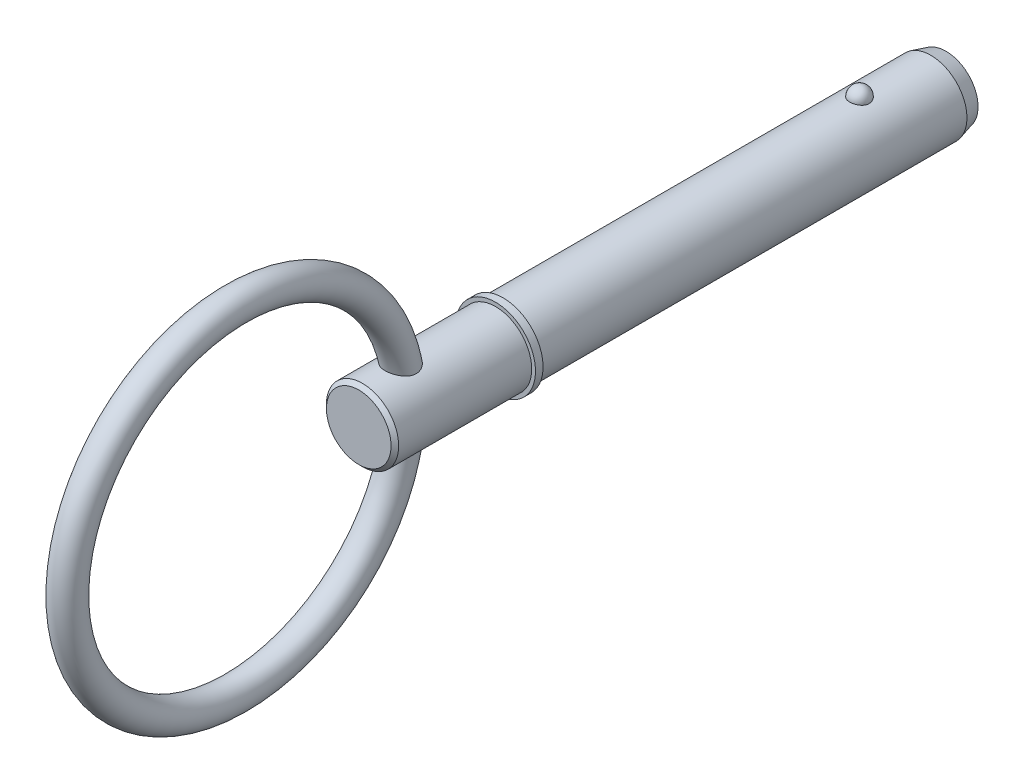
ISO-10303-21;
HEADER;
FILE_DESCRIPTION(('STEP AP214'),'2;1');
FILE_NAME('part.step','',(''),(''),'','','');
FILE_SCHEMA(('AUTOMOTIVE_DESIGN { 1 0 10303 214 1 1 1 1 }'));
ENDSEC;
DATA;
#1=APPLICATION_CONTEXT('core data for automotive mechanical design processes');
#2=APPLICATION_PROTOCOL_DEFINITION('international standard','automotive_design',2000,#1);
#3=PRODUCT_CONTEXT('',#1,'mechanical');
#4=PRODUCT('Part','Part','',(#3));
#5=PRODUCT_RELATED_PRODUCT_CATEGORY('part','',(#4));
#6=PRODUCT_DEFINITION_FORMATION('','',#4);
#7=PRODUCT_DEFINITION_CONTEXT('part definition',#1,'design');
#8=PRODUCT_DEFINITION('design','',#6,#7);
#9=PRODUCT_DEFINITION_SHAPE('','',#8);
#10=(LENGTH_UNIT() NAMED_UNIT(*) SI_UNIT(.MILLI.,.METRE.));
#11=(NAMED_UNIT(*) PLANE_ANGLE_UNIT() SI_UNIT($,.RADIAN.));
#12=(NAMED_UNIT(*) SI_UNIT($,.STERADIAN.) SOLID_ANGLE_UNIT());
#13=UNCERTAINTY_MEASURE_WITH_UNIT(LENGTH_MEASURE(1.E-05),#10,'distance_accuracy_value','');
#14=(GEOMETRIC_REPRESENTATION_CONTEXT(3) GLOBAL_UNCERTAINTY_ASSIGNED_CONTEXT((#13)) GLOBAL_UNIT_ASSIGNED_CONTEXT((#10,
#11,#12)) REPRESENTATION_CONTEXT('',''));
#15=CARTESIAN_POINT('',(0.,0.,0.));
#16=DIRECTION('',(0.,0.,1.));
#17=DIRECTION('',(1.,0.,0.));
#18=AXIS2_PLACEMENT_3D('',#15,#16,#17);
#19=CARTESIAN_POINT('',(0.,0.,45.72));
#20=DIRECTION('',(0.,0.,-1.));
#21=DIRECTION('',(-1.,0.,0.));
#22=AXIS2_PLACEMENT_3D('',#19,#20,#21);
#23=CYLINDRICAL_SURFACE('',#22,4.765);
#24=CARTESIAN_POINT('',(1.27812710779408,4.59038300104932,-1.29));
#25=CARTESIAN_POINT('',(1.27812572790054,4.59038414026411,-1.2178688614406));
#26=CARTESIAN_POINT('',(1.27223018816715,4.59203736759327,-1.14572000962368));
#27=CARTESIAN_POINT('',(1.24878929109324,4.59846646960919,-1.00346315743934));
#28=CARTESIAN_POINT('',(1.23123896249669,4.60324367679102,-0.933356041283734));
#29=CARTESIAN_POINT('',(1.18493861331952,4.61537801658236,-0.797215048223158));
#30=CARTESIAN_POINT('',(1.15619354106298,4.62273400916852,-0.731179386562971));
#31=CARTESIAN_POINT('',(1.08822596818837,4.6392032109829,-0.604986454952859));
#32=CARTESIAN_POINT('',(1.04900384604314,4.64831635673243,-0.544828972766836));
#33=CARTESIAN_POINT('',(0.960865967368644,4.66733302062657,-0.431775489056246));
#34=CARTESIAN_POINT('',(0.911906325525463,4.67723999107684,-0.37891426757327));
#35=CARTESIAN_POINT('',(0.805678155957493,4.69670280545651,-0.282245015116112));
#36=CARTESIAN_POINT('',(0.748409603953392,4.70625864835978,-0.238437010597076));
#37=CARTESIAN_POINT('',(0.627266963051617,4.72392767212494,-0.161207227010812));
#38=CARTESIAN_POINT('',(0.563411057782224,4.73204466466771,-0.127757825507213));
#39=CARTESIAN_POINT('',(0.430755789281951,4.74595788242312,-0.0720471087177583));
#40=CARTESIAN_POINT('',(0.361956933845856,4.75175434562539,-0.0497846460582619));
#41=CARTESIAN_POINT('',(0.222605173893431,4.76030056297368,-0.0173750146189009));
#42=CARTESIAN_POINT('',(0.152101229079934,4.76309991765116,-0.00703038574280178));
#43=CARTESIAN_POINT('',(0.0103009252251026,4.76551622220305,0.00191361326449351));
#44=CARTESIAN_POINT('',(-0.0609953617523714,4.76513345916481,0.000514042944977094));
#45=CARTESIAN_POINT('',(-0.201348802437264,4.76125496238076,-0.0138891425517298));
#46=CARTESIAN_POINT('',(-0.270423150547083,4.75780093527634,-0.0267372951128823));
#47=CARTESIAN_POINT('',(-0.405377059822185,4.74820737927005,-0.0634598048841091));
#48=CARTESIAN_POINT('',(-0.471256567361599,4.74206780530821,-0.0873343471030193));
#49=CARTESIAN_POINT('',(-0.598375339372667,4.72771507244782,-0.14561183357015));
#50=CARTESIAN_POINT('',(-0.659587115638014,4.71949070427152,-0.180071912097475));
#51=CARTESIAN_POINT('',(-0.775356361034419,4.70185936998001,-0.258542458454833));
#52=CARTESIAN_POINT('',(-0.8299131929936,4.69245229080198,-0.302553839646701));
#53=CARTESIAN_POINT('',(-0.931895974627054,4.67327936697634,-0.39982907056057));
#54=CARTESIAN_POINT('',(-0.979176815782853,4.66351011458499,-0.453244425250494));
#55=CARTESIAN_POINT('',(-1.06421220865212,4.64484426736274,-0.567321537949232));
#56=CARTESIAN_POINT('',(-1.10196613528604,4.63594772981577,-0.6279837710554));
#57=CARTESIAN_POINT('',(-1.16735225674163,4.61992036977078,-0.75558557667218));
#58=CARTESIAN_POINT('',(-1.19487251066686,4.61280933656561,-0.822585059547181));
#59=CARTESIAN_POINT('',(-1.23851975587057,4.60128324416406,-0.96041771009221));
#60=CARTESIAN_POINT('',(-1.25464705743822,4.59686811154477,-1.03125077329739));
#61=CARTESIAN_POINT('',(-1.27505790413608,4.59124882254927,-1.17443804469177));
#62=CARTESIAN_POINT('',(-1.27938868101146,4.59003186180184,-1.24678501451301));
#63=CARTESIAN_POINT('',(-1.27623192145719,4.5909105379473,-1.3911989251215));
#64=CARTESIAN_POINT('',(-1.26874468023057,4.59300609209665,-1.46326587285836));
#65=CARTESIAN_POINT('',(-1.24220427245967,4.60025423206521,-1.60473192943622));
#66=CARTESIAN_POINT('',(-1.2232043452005,4.60539274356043,-1.67414176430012));
#67=CARTESIAN_POINT('',(-1.17415910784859,4.61813957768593,-1.80870154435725));
#68=CARTESIAN_POINT('',(-1.1441133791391,4.62574799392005,-1.87385132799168));
#69=CARTESIAN_POINT('',(-1.07354327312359,4.64263368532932,-1.99841604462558));
#70=CARTESIAN_POINT('',(-1.03296580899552,4.65191934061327,-2.05779976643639));
#71=CARTESIAN_POINT('',(-0.942433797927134,4.67110036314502,-2.16881966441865));
#72=CARTESIAN_POINT('',(-0.892478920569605,4.68099575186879,-2.22045556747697));
#73=CARTESIAN_POINT('',(-0.784302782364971,4.70033161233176,-2.31471696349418));
#74=CARTESIAN_POINT('',(-0.726054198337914,4.70977043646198,-2.35731146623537));
#75=CARTESIAN_POINT('',(-0.602997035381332,4.72709995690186,-2.43206620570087));
#76=CARTESIAN_POINT('',(-0.538188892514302,4.73499075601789,-2.46422713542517));
#77=CARTESIAN_POINT('',(-0.404639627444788,4.7482563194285,-2.51687454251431));
#78=CARTESIAN_POINT('',(-0.335953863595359,4.7536596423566,-2.53749415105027));
#79=CARTESIAN_POINT('',(-0.195948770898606,4.76148510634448,-2.56703727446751));
#80=CARTESIAN_POINT('',(-0.124629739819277,4.76390758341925,-2.57596210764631));
#81=CARTESIAN_POINT('',(0.0172696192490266,4.76548774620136,-2.58180339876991));
#82=CARTESIAN_POINT('',(0.0878407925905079,4.76470225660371,-2.57892886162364));
#83=CARTESIAN_POINT('',(0.227467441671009,4.76008019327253,-2.56172603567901));
#84=CARTESIAN_POINT('',(0.296522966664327,4.75624371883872,-2.54739811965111));
#85=CARTESIAN_POINT('',(0.430942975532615,4.74595041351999,-2.50776251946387));
#86=CARTESIAN_POINT('',(0.496319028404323,4.7395023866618,-2.4824917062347));
#87=CARTESIAN_POINT('',(0.621860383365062,4.72467083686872,-2.4216730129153));
#88=CARTESIAN_POINT('',(0.682025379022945,4.71628720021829,-2.38612452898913));
#89=CARTESIAN_POINT('',(0.796409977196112,4.69833598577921,-2.30511163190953));
#90=CARTESIAN_POINT('',(0.850529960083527,4.68875291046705,-2.25951003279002));
#91=CARTESIAN_POINT('',(0.950412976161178,4.66953243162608,-2.15992428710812));
#92=CARTESIAN_POINT('',(0.996174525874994,4.65989501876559,-2.10593865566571));
#93=CARTESIAN_POINT('',(1.07885962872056,4.64145616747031,-1.99009376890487));
#94=CARTESIAN_POINT('',(1.11562789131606,4.63267081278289,-1.92812106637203));
#95=CARTESIAN_POINT('',(1.17840570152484,4.61710269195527,-1.79873681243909));
#96=CARTESIAN_POINT('',(1.20441973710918,4.61031909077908,-1.73132754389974));
#97=CARTESIAN_POINT('',(1.24242116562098,4.60021170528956,-1.60192906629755));
#98=CARTESIAN_POINT('',(1.25578772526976,4.59655387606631,-1.54036674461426));
#99=CARTESIAN_POINT('',(1.27364121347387,4.59163904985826,-1.41587409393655));
#100=CARTESIAN_POINT('',(1.2781283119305,4.59038200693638,-1.35294379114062));
#101=CARTESIAN_POINT('',(1.27812710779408,4.59038300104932,-1.29));
#102=B_SPLINE_CURVE_WITH_KNOTS('',3,(#24,#25,#26,#27,#28,#29,#30,#31,#32,#33,#34,#35,#36,#37,
#38,#39,#40,#41,#42,#43,#44,#45,#46,#47,#48,#49,#50,#51,#52,#53,#54,#55,#56,#57,#58,#59,#60,#61,
#62,#63,#64,#65,#66,#67,#68,#69,#70,#71,#72,#73,#74,#75,#76,#77,#78,#79,#80,#81,#82,#83,#84,#85,
#86,#87,#88,#89,#90,#91,#92,#93,#94,#95,#96,#97,#98,#99,#100,#101),.UNSPECIFIED.,.T.,.F.,(4,2,2,
2,2,2,2,2,2,2,2,2,2,2,2,2,2,2,2,2,2,2,2,2,2,2,2,2,2,2,2,2,2,2,2,2,2,2,4),(0.,0.216167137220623,
0.432426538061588,0.648590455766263,0.864746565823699,1.0818998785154,1.29905382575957,
1.51562361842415,1.73217119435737,1.94507683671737,2.15796327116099,2.36800220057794,
2.57804465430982,2.78924132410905,3.00045819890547,3.21545551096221,3.43046692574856,
3.64776550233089,3.8650581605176,4.08147951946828,4.29789547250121,4.51331818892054,
4.72874907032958,4.94528769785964,5.16183395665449,5.37911087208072,5.59637335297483,
5.8110751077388,6.02575265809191,6.23664413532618,6.44752874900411,6.65770827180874,
6.86790014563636,7.08116060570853,7.29445887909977,7.51121476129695,7.72788009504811,
7.91651762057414,8.10515153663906),.UNSPECIFIED.);
#103=CARTESIAN_POINT('',(1.27812710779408,4.59038300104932,-1.29));
#104=VERTEX_POINT('',#103);
#105=EDGE_CURVE('E103',#104,#104,#102,.T.);
#106=ORIENTED_EDGE('',*,*,#105,.T.);
#107=EDGE_LOOP('',(#106));
#108=FACE_BOUND('',#107,.T.);
#109=CARTESIAN_POINT('',(0.,0.,-10.7));
#110=DIRECTION('',(0.,0.,-1.));
#111=DIRECTION('',(-1.,0.,0.));
#112=AXIS2_PLACEMENT_3D('',#109,#110,#111);
#113=CIRCLE('',#112,4.765);
#114=CARTESIAN_POINT('',(-4.765,0.,-10.7));
#115=VERTEX_POINT('',#114);
#116=EDGE_CURVE('E110',#115,#115,#113,.F.);
#117=ORIENTED_EDGE('',*,*,#116,.T.);
#118=EDGE_LOOP('',(#117));
#119=FACE_BOUND('',#118,.T.);
#120=CARTESIAN_POINT('',(0.,0.,45.72));
#121=DIRECTION('',(0.,0.,1.));
#122=DIRECTION('',(1.,0.,0.));
#123=AXIS2_PLACEMENT_3D('',#120,#121,#122);
#124=CIRCLE('',#123,4.765);
#125=CARTESIAN_POINT('',(4.765,0.,45.72));
#126=VERTEX_POINT('',#125);
#127=EDGE_CURVE('E108',#126,#126,#124,.T.);
#128=ORIENTED_EDGE('',*,*,#127,.F.);
#129=EDGE_LOOP('',(#128));
#130=FACE_BOUND('',#129,.T.);
#131=ADVANCED_FACE('F39',(#108,#119,#130),#23,.T.);
#132=CARTESIAN_POINT('',(0.,0.,-12.7));
#133=DIRECTION('',(0.,0.,-1.));
#134=DIRECTION('',(-1.,0.,0.));
#135=AXIS2_PLACEMENT_3D('',#132,#133,#134);
#136=PLANE('',#135);
#137=CARTESIAN_POINT('',(0.,0.,-12.7));
#138=DIRECTION('',(0.,0.,-1.));
#139=DIRECTION('',(-1.,0.,0.));
#140=AXIS2_PLACEMENT_3D('',#137,#138,#139);
#141=CIRCLE('',#140,4.22910161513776);
#142=CARTESIAN_POINT('',(-4.22910161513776,0.,-12.7));
#143=VERTEX_POINT('',#142);
#144=EDGE_CURVE('E142',#143,#143,#141,.T.);
#145=ORIENTED_EDGE('',*,*,#144,.T.);
#146=EDGE_LOOP('',(#145));
#147=FACE_BOUND('',#146,.T.);
#148=ADVANCED_FACE('F89',(#147),#136,.T.);
#149=CARTESIAN_POINT('',(0.,0.,-12.7));
#150=DIRECTION('',(0.,0.,1.));
#151=DIRECTION('',(1.,0.,0.));
#152=AXIS2_PLACEMENT_3D('',#149,#150,#151);
#153=CONICAL_SURFACE('',#152,4.22910161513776,0.261799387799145);
#154=ORIENTED_EDGE('',*,*,#116,.F.);
#155=EDGE_LOOP('',(#154));
#156=FACE_BOUND('',#155,.T.);
#157=ORIENTED_EDGE('',*,*,#144,.F.);
#158=EDGE_LOOP('',(#157));
#159=FACE_BOUND('',#158,.T.);
#160=ADVANCED_FACE('F95',(#156,#159),#153,.T.);
#161=CARTESIAN_POINT('',(0.,4.765,-1.29));
#162=DIRECTION('',(0.,1.,0.));
#163=DIRECTION('',(0.,0.,-1.));
#164=AXIS2_PLACEMENT_3D('',#161,#162,#163);
#165=SPHERICAL_SURFACE('',#164,1.29);
#166=ORIENTED_EDGE('',*,*,#105,.F.);
#167=EDGE_LOOP('',(#166));
#168=FACE_BOUND('',#167,.T.);
#169=ADVANCED_FACE('F113',(#168),#165,.T.);
#170=CARTESIAN_POINT('',(0.,0.,45.72));
#171=DIRECTION('',(0.,0.,-1.));
#172=DIRECTION('',(-1.,0.,0.));
#173=AXIS2_PLACEMENT_3D('',#170,#171,#172);
#174=PLANE('',#173);
#175=ORIENTED_EDGE('',*,*,#127,.T.);
#176=EDGE_LOOP('',(#175));
#177=FACE_BOUND('',#176,.T.);
#178=CARTESIAN_POINT('',(0.,0.,45.72));
#179=DIRECTION('',(0.,0.,-1.));
#180=DIRECTION('',(-1.,0.,0.));
#181=AXIS2_PLACEMENT_3D('',#178,#179,#180);
#182=CIRCLE('',#181,5.265);
#183=CARTESIAN_POINT('',(-5.265,0.,45.72));
#184=VERTEX_POINT('',#183);
#185=EDGE_CURVE('E109',#184,#184,#182,.T.);
#186=ORIENTED_EDGE('',*,*,#185,.T.);
#187=EDGE_LOOP('',(#186));
#188=FACE_BOUND('',#187,.T.);
#189=ADVANCED_FACE('F117',(#177,#188),#174,.T.);
#190=CARTESIAN_POINT('',(0.,0.,33.7287874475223));
#191=DIRECTION('',(0.,0.,-1.));
#192=DIRECTION('',(-1.,0.,0.));
#193=AXIS2_PLACEMENT_3D('',#190,#191,#192);
#194=CYLINDRICAL_SURFACE('',#193,5.265);
#195=CARTESIAN_POINT('',(0.,0.,46.72));
#196=DIRECTION('',(0.,0.,-1.));
#197=DIRECTION('',(-1.,0.,0.));
#198=AXIS2_PLACEMENT_3D('',#195,#196,#197);
#199=CIRCLE('',#198,5.265);
#200=CARTESIAN_POINT('',(-5.265,0.,46.72));
#201=VERTEX_POINT('',#200);
#202=EDGE_CURVE('E134',#201,#201,#199,.T.);
#203=ORIENTED_EDGE('',*,*,#202,.T.);
#204=EDGE_LOOP('',(#203));
#205=FACE_BOUND('',#204,.T.);
#206=ORIENTED_EDGE('',*,*,#185,.F.);
#207=EDGE_LOOP('',(#206));
#208=FACE_BOUND('',#207,.T.);
#209=ADVANCED_FACE('F121',(#205,#208),#194,.T.);
#210=CARTESIAN_POINT('',(0.,5.265,46.72));
#211=DIRECTION('',(0.,0.,1.));
#212=DIRECTION('',(1.,0.,0.));
#213=AXIS2_PLACEMENT_3D('',#210,#211,#212);
#214=PLANE('',#213);
#215=CARTESIAN_POINT('',(0.,0.,46.72));
#216=DIRECTION('',(0.,0.,1.));
#217=DIRECTION('',(1.,0.,0.));
#218=AXIS2_PLACEMENT_3D('',#215,#216,#217);
#219=CIRCLE('',#218,4.765);
#220=CARTESIAN_POINT('',(4.765,0.,46.72));
#221=VERTEX_POINT('',#220);
#222=EDGE_CURVE('E112',#221,#221,#219,.T.);
#223=ORIENTED_EDGE('',*,*,#222,.F.);
#224=EDGE_LOOP('',(#223));
#225=FACE_BOUND('',#224,.T.);
#226=ORIENTED_EDGE('',*,*,#202,.F.);
#227=EDGE_LOOP('',(#226));
#228=FACE_BOUND('',#227,.T.);
#229=ADVANCED_FACE('F86',(#225,#228),#214,.T.);
#230=CARTESIAN_POINT('',(0.,0.,64.77));
#231=DIRECTION('',(0.,0.,-1.));
#232=DIRECTION('',(-1.,0.,0.));
#233=AXIS2_PLACEMENT_3D('',#230,#231,#232);
#234=CYLINDRICAL_SURFACE('',#233,4.765);
#235=CARTESIAN_POINT('',(-1.17603588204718,-4.61759294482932,57.6037200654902));
#236=CARTESIAN_POINT('',(-1.08605054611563,-4.6405075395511,57.5415688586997));
#237=CARTESIAN_POINT('',(-0.990486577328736,-4.66202408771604,57.4867393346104));
#238=CARTESIAN_POINT('',(-0.790762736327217,-4.70002969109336,57.3929957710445));
#239=CARTESIAN_POINT('',(-0.686587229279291,-4.7165093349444,57.3541114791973));
#240=CARTESIAN_POINT('',(-0.472539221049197,-4.7427361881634,57.293267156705));
#241=CARTESIAN_POINT('',(-0.362665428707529,-4.7524818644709,57.2713109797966));
#242=CARTESIAN_POINT('',(-0.140482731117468,-4.7642267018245,57.2449366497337));
#243=CARTESIAN_POINT('',(-0.0281752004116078,-4.7662301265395,57.2405088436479));
#244=CARTESIAN_POINT('',(0.193745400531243,-4.76233166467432,57.2492082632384));
#245=CARTESIAN_POINT('',(0.303372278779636,-4.75656024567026,57.2620457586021));
#246=CARTESIAN_POINT('',(0.518724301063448,-4.73791484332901,57.3044340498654));
#247=CARTESIAN_POINT('',(0.624448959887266,-4.72503997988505,57.3339869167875));
#248=CARTESIAN_POINT('',(0.829434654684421,-4.69340588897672,57.4092085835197));
#249=CARTESIAN_POINT('',(0.92867434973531,-4.6746283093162,57.4549277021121));
#250=CARTESIAN_POINT('',(1.11777413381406,-4.63305392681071,57.5614733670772));
#251=CARTESIAN_POINT('',(1.20763216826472,-4.61025624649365,57.6223032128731));
#252=CARTESIAN_POINT('',(1.37762760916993,-4.56238439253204,57.7594393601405));
#253=CARTESIAN_POINT('',(1.45749020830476,-4.53726959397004,57.8360728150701));
#254=CARTESIAN_POINT('',(1.60275140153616,-4.48801828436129,58.0022939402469));
#255=CARTESIAN_POINT('',(1.66815155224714,-4.46388166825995,58.091880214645));
#256=CARTESIAN_POINT('',(1.78162069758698,-4.41980966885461,58.2804689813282));
#257=CARTESIAN_POINT('',(1.82993675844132,-4.3998162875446,58.3793086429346));
#258=CARTESIAN_POINT('',(1.90902953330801,-4.36608532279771,58.5847395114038));
#259=CARTESIAN_POINT('',(1.93981696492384,-4.35234391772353,58.6913259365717));
#260=CARTESIAN_POINT('',(1.9818112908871,-4.33337618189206,58.9023805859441));
#261=CARTESIAN_POINT('',(1.99406945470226,-4.32769391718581,59.00660066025));
#262=CARTESIAN_POINT('',(2.0025484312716,-4.32377679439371,59.2158125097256));
#263=CARTESIAN_POINT('',(1.99876733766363,-4.32554282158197,59.3208043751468));
#264=CARTESIAN_POINT('',(1.97595504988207,-4.33600911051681,59.5291056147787));
#265=CARTESIAN_POINT('',(1.95686739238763,-4.3447350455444,59.6324073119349));
#266=CARTESIAN_POINT('',(1.90457346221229,-4.36790947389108,59.8346792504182));
#267=CARTESIAN_POINT('',(1.87136191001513,-4.38236010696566,59.9336478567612));
#268=CARTESIAN_POINT('',(1.78747856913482,-4.41728816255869,60.1364706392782));
#269=CARTESIAN_POINT('',(1.73524632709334,-4.43826528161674,60.2395927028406));
#270=CARTESIAN_POINT('',(1.61607256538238,-4.48303292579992,60.4363865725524));
#271=CARTESIAN_POINT('',(1.5491157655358,-4.50682636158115,60.5300484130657));
#272=CARTESIAN_POINT('',(1.39359064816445,-4.55746895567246,60.7153838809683));
#273=CARTESIAN_POINT('',(1.30346928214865,-4.58437060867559,60.8057503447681));
#274=CARTESIAN_POINT('',(1.10794390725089,-4.6354985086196,60.9690111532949));
#275=CARTESIAN_POINT('',(1.00255934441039,-4.65972809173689,61.0419274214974));
#276=CARTESIAN_POINT('',(0.803761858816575,-4.69755503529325,61.1524077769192));
#277=CARTESIAN_POINT('',(0.712935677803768,-4.71231838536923,61.1942306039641));
#278=CARTESIAN_POINT('',(0.525172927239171,-4.73691370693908,61.2629362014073));
#279=CARTESIAN_POINT('',(0.428242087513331,-4.7467502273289,61.2898327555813));
#280=CARTESIAN_POINT('',(0.230351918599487,-4.76046566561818,61.3271470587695));
#281=CARTESIAN_POINT('',(0.129376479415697,-4.76431768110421,61.3374904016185));
#282=CARTESIAN_POINT('',(-0.0728965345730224,-4.76551495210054,61.3407168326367));
#283=CARTESIAN_POINT('',(-0.174194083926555,-4.76286070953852,61.3336012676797));
#284=CARTESIAN_POINT('',(-0.366467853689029,-4.751792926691,61.3035798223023));
#285=CARTESIAN_POINT('',(-0.457659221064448,-4.74381187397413,61.2818588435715));
#286=CARTESIAN_POINT('',(-0.63522668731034,-4.72331548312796,61.2250844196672));
#287=CARTESIAN_POINT('',(-0.721601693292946,-4.71079912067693,61.1900279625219));
#288=CARTESIAN_POINT('',(-0.893212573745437,-4.68139468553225,61.1055597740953));
#289=CARTESIAN_POINT('',(-0.978027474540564,-4.66427939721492,61.0553775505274));
#290=CARTESIAN_POINT('',(-1.13917803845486,-4.62756330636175,60.9436420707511));
#291=CARTESIAN_POINT('',(-1.21550961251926,-4.60796131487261,60.8820833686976));
#292=CARTESIAN_POINT('',(-1.37033540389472,-4.56452178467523,60.7386885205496));
#293=CARTESIAN_POINT('',(-1.44723650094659,-4.5405070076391,60.6551843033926));
#294=CARTESIAN_POINT('',(-1.587638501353,-4.49334232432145,60.4772920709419));
#295=CARTESIAN_POINT('',(-1.65112672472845,-4.47019325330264,60.3828938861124));
#296=CARTESIAN_POINT('',(-1.77033243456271,-4.42444393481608,60.1732060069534));
#297=CARTESIAN_POINT('',(-1.82420433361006,-4.40224259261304,60.0567685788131));
#298=CARTESIAN_POINT('',(-1.91169086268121,-4.36496831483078,59.8154090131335));
#299=CARTESIAN_POINT('',(-1.94531523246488,-4.34989195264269,59.6904909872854));
#300=CARTESIAN_POINT('',(-1.98892523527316,-4.33012255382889,59.4420163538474));
#301=CARTESIAN_POINT('',(-1.99998275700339,-4.32495941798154,59.3186899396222));
#302=CARTESIAN_POINT('',(-2.00001713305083,-4.32494814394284,59.0720738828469));
#303=CARTESIAN_POINT('',(-1.98902141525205,-4.33008719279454,58.9487843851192));
#304=CARTESIAN_POINT('',(-1.94752572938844,-4.34888267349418,58.7232137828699));
#305=CARTESIAN_POINT('',(-1.91979754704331,-4.36132278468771,58.6203106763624));
#306=CARTESIAN_POINT('',(-1.84805595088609,-4.39220107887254,58.4212512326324));
#307=CARTESIAN_POINT('',(-1.80403476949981,-4.4106421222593,58.3250981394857));
#308=CARTESIAN_POINT('',(-1.70232000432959,-4.4508689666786,58.1444579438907));
#309=CARTESIAN_POINT('',(-1.64499853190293,-4.47255887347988,58.0597380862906));
#310=CARTESIAN_POINT('',(-1.51770958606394,-4.51733419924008,57.9010122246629));
#311=CARTESIAN_POINT('',(-1.44776268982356,-4.54041730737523,57.8269891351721));
#312=CARTESIAN_POINT('',(-1.34143544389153,-4.57239833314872,57.73104340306));
#313=CARTESIAN_POINT('',(-1.30955259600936,-4.58164274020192,57.7041153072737));
#314=CARTESIAN_POINT('',(-1.24406394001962,-4.59985727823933,57.6523409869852));
#315=CARTESIAN_POINT('',(-1.21045807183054,-4.6088273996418,57.6274948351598));
#316=CARTESIAN_POINT('',(-1.17603588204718,-4.61759294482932,57.6037200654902));
#317=B_SPLINE_CURVE_WITH_KNOTS('',3,(#235,#236,#237,#238,#239,#240,#241,#242,#243,#244,#245,
#246,#247,#248,#249,#250,#251,#252,#253,#254,#255,#256,#257,#258,#259,#260,#261,#262,#263,#264,
#265,#266,#267,#268,#269,#270,#271,#272,#273,#274,#275,#276,#277,#278,#279,#280,#281,#282,#283,
#284,#285,#286,#287,#288,#289,#290,#291,#292,#293,#294,#295,#296,#297,#298,#299,#300,#301,#302,
#303,#304,#305,#306,#307,#308,#309,#310,#311,#312,#313,#314,#315,#316),.UNSPECIFIED.,.T.,.F.,(4,
2,2,2,2,2,2,2,2,2,2,2,2,2,2,2,2,2,2,2,2,2,2,2,2,2,2,2,2,2,2,2,2,2,2,2,2,2,2,2,4),(0.,
0.335054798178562,0.670731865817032,1.00648532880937,1.34205386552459,1.67206089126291,
2.00210881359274,2.33319321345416,2.66434996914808,3.00321157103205,3.34203668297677,
3.67573940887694,4.0092378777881,4.32299322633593,4.6367858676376,4.95174139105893,
5.26681474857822,5.6178575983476,5.96926647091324,6.35862694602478,6.74749565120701,
7.04947204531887,7.35116911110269,7.65421852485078,7.95724456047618,8.23825252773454,
8.51932400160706,8.81825171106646,9.11732288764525,9.46404422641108,9.81109188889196,
10.1997682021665,10.5882573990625,10.9578189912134,11.32692124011,11.6472091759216,
11.9676500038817,12.2800235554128,12.5918925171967,12.7200569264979,12.8482258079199),.UNSPECIFIED.);
#318=CARTESIAN_POINT('',(-1.17603588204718,-4.61759294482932,57.6037200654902));
#319=VERTEX_POINT('',#318);
#320=EDGE_CURVE('E10',#319,#319,#317,.T.);
#321=ORIENTED_EDGE('',*,*,#320,.F.);
#322=EDGE_LOOP('',(#321));
#323=FACE_BOUND('',#322,.T.);
#324=CARTESIAN_POINT('',(-1.17603588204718,4.61759294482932,57.6037200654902));
#325=CARTESIAN_POINT('',(-1.26499234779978,4.59493450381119,57.6651699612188));
#326=CARTESIAN_POINT('',(-1.34870034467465,4.57085993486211,57.7339152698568));
#327=CARTESIAN_POINT('',(-1.50334626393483,4.52236448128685,57.884635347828));
#328=CARTESIAN_POINT('',(-1.57425996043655,4.49794303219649,57.9666346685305));
#329=CARTESIAN_POINT('',(-1.7013018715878,4.45144771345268,58.1422345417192));
#330=CARTESIAN_POINT('',(-1.75740699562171,4.42937754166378,58.2358528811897));
#331=CARTESIAN_POINT('',(-1.85287755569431,4.39030189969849,58.4321668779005));
#332=CARTESIAN_POINT('',(-1.89225871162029,4.37329167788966,58.5348539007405));
#333=CARTESIAN_POINT('',(-1.95188661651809,4.34699775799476,58.7418576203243));
#334=CARTESIAN_POINT('',(-1.97286468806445,4.33742068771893,58.8459265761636));
#335=CARTESIAN_POINT('',(-1.99814509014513,4.32583397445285,59.0564714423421));
#336=CARTESIAN_POINT('',(-2.00244696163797,4.32382453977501,59.1629474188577));
#337=CARTESIAN_POINT('',(-1.99499900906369,4.32726361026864,59.3727706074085));
#338=CARTESIAN_POINT('',(-1.9836061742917,4.33254625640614,59.476134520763));
#339=CARTESIAN_POINT('',(-1.94643618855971,4.34936983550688,59.6796911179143));
#340=CARTESIAN_POINT('',(-1.92065444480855,4.3609127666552,59.7798827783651));
#341=CARTESIAN_POINT('',(-1.85292379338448,4.3901452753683,59.9841042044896));
#342=CARTESIAN_POINT('',(-1.80971134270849,4.40830066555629,60.0876462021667));
#343=CARTESIAN_POINT('',(-1.70892742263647,4.44833985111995,60.2867684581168));
#344=CARTESIAN_POINT('',(-1.65134284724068,4.47022704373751,60.3823413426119));
#345=CARTESIAN_POINT('',(-1.51475300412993,4.51847764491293,60.5752600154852));
#346=CARTESIAN_POINT('',(-1.43395667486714,4.54505660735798,60.6712914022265));
#347=CARTESIAN_POINT('',(-1.25684082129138,4.59718102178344,60.8481328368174));
#348=CARTESIAN_POINT('',(-1.1605312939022,4.62272712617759,60.9289526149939));
#349=CARTESIAN_POINT('',(-0.972192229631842,4.66558476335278,61.0593265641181));
#350=CARTESIAN_POINT('',(-0.882391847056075,4.68355428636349,61.1118799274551));
#351=CARTESIAN_POINT('',(-0.694836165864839,4.71502283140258,61.2020221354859));
#352=CARTESIAN_POINT('',(-0.597087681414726,4.72852563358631,61.2396236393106));
#353=CARTESIAN_POINT('',(-0.395321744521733,4.74966109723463,61.2978751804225));
#354=CARTESIAN_POINT('',(-0.291269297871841,4.75725698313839,61.3184190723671));
#355=CARTESIAN_POINT('',(-0.080897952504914,4.76547327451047,61.3406246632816));
#356=CARTESIAN_POINT('',(0.0254198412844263,4.76609700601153,61.3422953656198));
#357=CARTESIAN_POINT('',(0.225327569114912,4.7606097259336,61.3274850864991));
#358=CARTESIAN_POINT('',(0.31908414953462,4.75519734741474,61.3128871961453));
#359=CARTESIAN_POINT('',(0.502750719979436,4.73930039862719,61.2693972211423));
#360=CARTESIAN_POINT('',(0.592660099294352,4.72881502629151,61.240502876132));
#361=CARTESIAN_POINT('',(0.768777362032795,4.70343779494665,61.1690413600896));
#362=CARTESIAN_POINT('',(0.854839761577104,4.68844387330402,61.1261552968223));
#363=CARTESIAN_POINT('',(1.01943666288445,4.65543047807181,61.0287469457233));
#364=CARTESIAN_POINT('',(1.09796821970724,4.63740982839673,60.9742201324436));
#365=CARTESIAN_POINT('',(1.25751825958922,4.59691257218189,60.8464656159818));
#366=CARTESIAN_POINT('',(1.33721103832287,4.57417011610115,60.7716678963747));
#367=CARTESIAN_POINT('',(1.48461190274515,4.52847869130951,60.6110829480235));
#368=CARTESIAN_POINT('',(1.55230949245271,4.50552956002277,60.5252862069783));
#369=CARTESIAN_POINT('',(1.68366050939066,4.45825797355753,60.3314045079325));
#370=CARTESIAN_POINT('',(1.74532014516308,4.4342153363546,60.2218899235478));
#371=CARTESIAN_POINT('',(1.85007805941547,4.39154308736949,59.9932696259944));
#372=CARTESIAN_POINT('',(1.89317429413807,4.37291407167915,59.8741628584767));
#373=CARTESIAN_POINT('',(1.958572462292,4.34402041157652,59.6297631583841));
#374=CARTESIAN_POINT('',(1.98095022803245,4.33372528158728,59.504494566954));
#375=CARTESIAN_POINT('',(2.00301292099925,4.32358016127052,59.2515942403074));
#376=CARTESIAN_POINT('',(2.00273000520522,4.32371536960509,59.1239661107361));
#377=CARTESIAN_POINT('',(1.97997568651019,4.3341693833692,58.8882474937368));
#378=CARTESIAN_POINT('',(1.96044562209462,4.34313814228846,58.7798066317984));
#379=CARTESIAN_POINT('',(1.903681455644,4.3683153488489,58.5685431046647));
#380=CARTESIAN_POINT('',(1.86644884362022,4.38452318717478,58.4657199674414));
#381=CARTESIAN_POINT('',(1.7781154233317,4.42104679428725,58.2747100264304));
#382=CARTESIAN_POINT('',(1.72797707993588,4.44105894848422,58.1860156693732));
#383=CARTESIAN_POINT('',(1.61439500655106,4.48359504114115,58.0182868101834));
#384=CARTESIAN_POINT('',(1.55094927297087,4.50611935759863,57.9392537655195));
#385=CARTESIAN_POINT('',(1.40889349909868,4.55259151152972,57.7887053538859));
#386=CARTESIAN_POINT('',(1.32968750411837,4.57655455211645,57.7177571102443));
#387=CARTESIAN_POINT('',(1.16035884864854,4.62238936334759,57.5895060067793));
#388=CARTESIAN_POINT('',(1.070233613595,4.64426063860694,57.5322063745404));
#389=CARTESIAN_POINT('',(0.877362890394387,4.68460759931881,57.4303166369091));
#390=CARTESIAN_POINT('',(0.774249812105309,4.70290564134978,57.3863495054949));
#391=CARTESIAN_POINT('',(0.561430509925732,4.73302876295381,57.3154843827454));
#392=CARTESIAN_POINT('',(0.451725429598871,4.74485496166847,57.2885834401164));
#393=CARTESIAN_POINT('',(0.230282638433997,4.76071009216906,57.2527633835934));
#394=CARTESIAN_POINT('',(0.118587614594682,4.76483485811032,57.2436232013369));
#395=CARTESIAN_POINT('',(-0.104911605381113,4.76515532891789,57.2429082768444));
#396=CARTESIAN_POINT('',(-0.216715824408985,4.76134861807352,57.2513388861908));
#397=CARTESIAN_POINT('',(-0.435231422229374,4.74632552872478,57.2852456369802));
#398=CARTESIAN_POINT('',(-0.541996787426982,4.73523460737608,57.3104332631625));
#399=CARTESIAN_POINT('',(-0.749371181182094,4.70686626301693,57.3769215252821));
#400=CARTESIAN_POINT('',(-0.849990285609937,4.68959930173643,57.4181949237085));
#401=CARTESIAN_POINT('',(-0.986108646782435,4.6620261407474,57.4872359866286));
#402=CARTESIAN_POINT('',(-1.02525769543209,4.65355983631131,57.5087724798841));
#403=CARTESIAN_POINT('',(-1.10191286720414,4.63600664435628,57.5543673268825));
#404=CARTESIAN_POINT('',(-1.13941901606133,4.62691976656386,57.578425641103));
#405=CARTESIAN_POINT('',(-1.17603588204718,4.61759294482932,57.6037200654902));
#406=B_SPLINE_CURVE_WITH_KNOTS('',3,(#324,#325,#326,#327,#328,#329,#330,#331,#332,#333,#334,
#335,#336,#337,#338,#339,#340,#341,#342,#343,#344,#345,#346,#347,#348,#349,#350,#351,#352,#353,
#354,#355,#356,#357,#358,#359,#360,#361,#362,#363,#364,#365,#366,#367,#368,#369,#370,#371,#372,
#373,#374,#375,#376,#377,#378,#379,#380,#381,#382,#383,#384,#385,#386,#387,#388,#389,#390,#391,
#392,#393,#394,#395,#396,#397,#398,#399,#400,#401,#402,#403,#404,#405),.UNSPECIFIED.,.T.,.F.,(4,
2,2,2,2,2,2,2,2,2,2,2,2,2,2,2,2,2,2,2,2,2,2,2,2,2,2,2,2,2,2,2,2,2,2,2,2,2,2,2,4),(0.,
0.331234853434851,0.66309046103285,0.995460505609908,1.3275174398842,1.64568783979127,
1.96386699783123,2.2749271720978,2.58608669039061,2.92571998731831,3.26566413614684,
3.64875195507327,4.03159388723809,4.34706664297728,4.66227172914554,4.97942386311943,
5.29642469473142,5.58021908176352,5.86405835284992,6.15488068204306,6.44581627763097,
6.77943874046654,7.11335170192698,7.49545660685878,7.87760356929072,8.25834622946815,
8.63854860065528,8.96843568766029,9.29829501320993,9.60842872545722,9.91860916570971,
10.2441707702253,10.5698092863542,10.9089029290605,11.2479379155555,11.5827251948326,
11.9176144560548,12.2468820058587,12.5755944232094,12.7119417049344,12.8482868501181),.UNSPECIFIED.);
#407=CARTESIAN_POINT('',(-1.17603588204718,4.61759294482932,57.6037200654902));
#408=VERTEX_POINT('',#407);
#409=EDGE_CURVE('E51',#408,#408,#406,.T.);
#410=ORIENTED_EDGE('',*,*,#409,.F.);
#411=EDGE_LOOP('',(#410));
#412=FACE_BOUND('',#411,.T.);
#413=CARTESIAN_POINT('',(0.,0.,64.27));
#414=DIRECTION('',(0.,0.,-1.));
#415=DIRECTION('',(-1.,0.,0.));
#416=AXIS2_PLACEMENT_3D('',#413,#414,#415);
#417=CIRCLE('',#416,4.765);
#418=CARTESIAN_POINT('',(-4.765,0.,64.27));
#419=VERTEX_POINT('',#418);
#420=EDGE_CURVE('E65',#419,#419,#417,.T.);
#421=ORIENTED_EDGE('',*,*,#420,.T.);
#422=EDGE_LOOP('',(#421));
#423=FACE_BOUND('',#422,.T.);
#424=ORIENTED_EDGE('',*,*,#222,.T.);
#425=EDGE_LOOP('',(#424));
#426=FACE_BOUND('',#425,.T.);
#427=ADVANCED_FACE('F70',(#323,#412,#423,#426),#234,.T.);
#428=CARTESIAN_POINT('',(0.,0.,64.77));
#429=DIRECTION('',(0.,0.,-1.));
#430=DIRECTION('',(-1.,0.,0.));
#431=AXIS2_PLACEMENT_3D('',#428,#429,#430);
#432=PLANE('',#431);
#433=CARTESIAN_POINT('',(0.,0.,64.77));
#434=DIRECTION('',(0.,0.,-1.));
#435=DIRECTION('',(-1.,0.,0.));
#436=AXIS2_PLACEMENT_3D('',#433,#434,#435);
#437=CIRCLE('',#436,4.26499999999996);
#438=CARTESIAN_POINT('',(-4.26499999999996,0.,64.77));
#439=VERTEX_POINT('',#438);
#440=EDGE_CURVE('E58',#439,#439,#437,.F.);
#441=ORIENTED_EDGE('',*,*,#440,.T.);
#442=EDGE_LOOP('',(#441));
#443=FACE_BOUND('',#442,.T.);
#444=ADVANCED_FACE('F77',(#443),#432,.F.);
#445=CARTESIAN_POINT('',(0.,0.,64.27));
#446=DIRECTION('',(0.,0.,-1.));
#447=DIRECTION('',(-1.,0.,0.));
#448=AXIS2_PLACEMENT_3D('',#445,#446,#447);
#449=CONICAL_SURFACE('',#448,4.765,0.785398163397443);
#450=ORIENTED_EDGE('',*,*,#440,.F.);
#451=EDGE_LOOP('',(#450));
#452=FACE_BOUND('',#451,.T.);
#453=ORIENTED_EDGE('',*,*,#420,.F.);
#454=EDGE_LOOP('',(#453));
#455=FACE_BOUND('',#454,.T.);
#456=ADVANCED_FACE('F41',(#452,#455),#449,.T.);
#457=CARTESIAN_POINT('',(0.,0.,80.995));
#458=DIRECTION('',(1.,0.,0.));
#459=DIRECTION('',(0.,0.,-1.));
#460=AXIS2_PLACEMENT_3D('',#457,#458,#459);
#461=TOROIDAL_SURFACE('',#460,22.225,2.);
#462=ORIENTED_EDGE('',*,*,#320,.T.);
#463=EDGE_LOOP('',(#462));
#464=FACE_BOUND('',#463,.T.);
#465=ORIENTED_EDGE('',*,*,#409,.T.);
#466=EDGE_LOOP('',(#465));
#467=FACE_BOUND('',#466,.T.);
#468=ADVANCED_FACE('F74',(#464,#467),#461,.T.);
#469=CLOSED_SHELL('',(#131,#148,#160,#169,#189,#209,#229,#427,#444,#456,#468));
#470=MANIFOLD_SOLID_BREP('B2',#469);
#471=ADVANCED_BREP_SHAPE_REPRESENTATION('',(#18,#470),#14);
#472=SHAPE_DEFINITION_REPRESENTATION(#9,#471);
ENDSEC;
END-ISO-10303-21;
